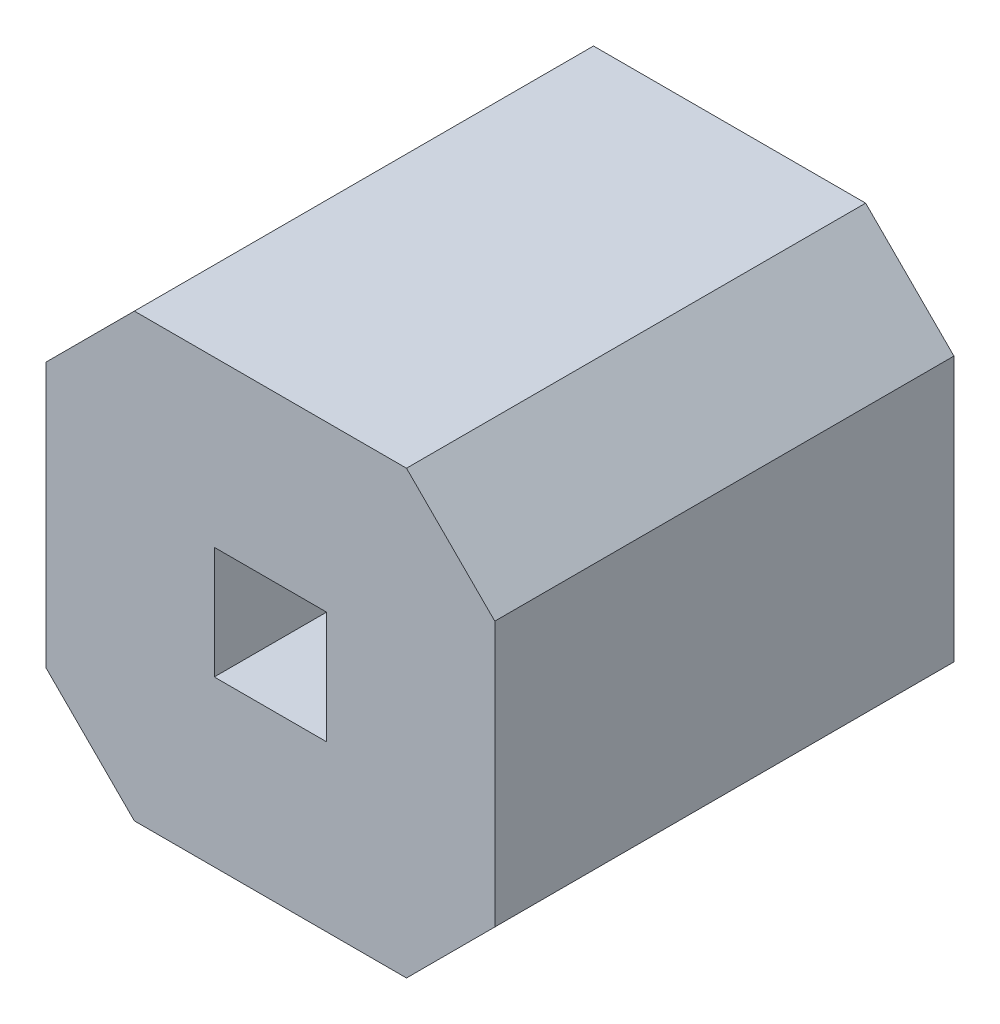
from build123d import *

# Parameters (mm, degrees)
CROQUIS1_W              = 2.541
CROQUIS1_H              = 2.5
CROQUIS1_W_2            = 0.636
CROQUIS1_H_2            = 0.636
SALIENTE_EXTRUIR2_DEPTH = 2.6
CHAFL_N2_SIZE           = 0.5


with BuildPart() as part:
    # Croquis1 → Saliente-Extruir2 (new body)
    with BuildSketch(Plane.XY):
        with Locations((1.2705, -1.25)):
            Rectangle(CROQUIS1_W, CROQUIS1_H)
        with Locations((1.2705, -1.25)):
            Rectangle(CROQUIS1_W_2, CROQUIS1_H_2, mode=Mode.SUBTRACT)
    extrude(amount=SALIENTE_EXTRUIR2_DEPTH)

    # Chafl_n2
    chafl_n2_edges = [part.edges().sort_by_distance(p)[0] for p in [
        (0, 0, 1.3),
        (2.541, 0, 1.3),
        (2.541, -2.5, 1.3),
        (0, -2.5, 1.3),
    ]]
    chamfer(chafl_n2_edges, length=CHAFL_N2_SIZE)


solid = part.part
